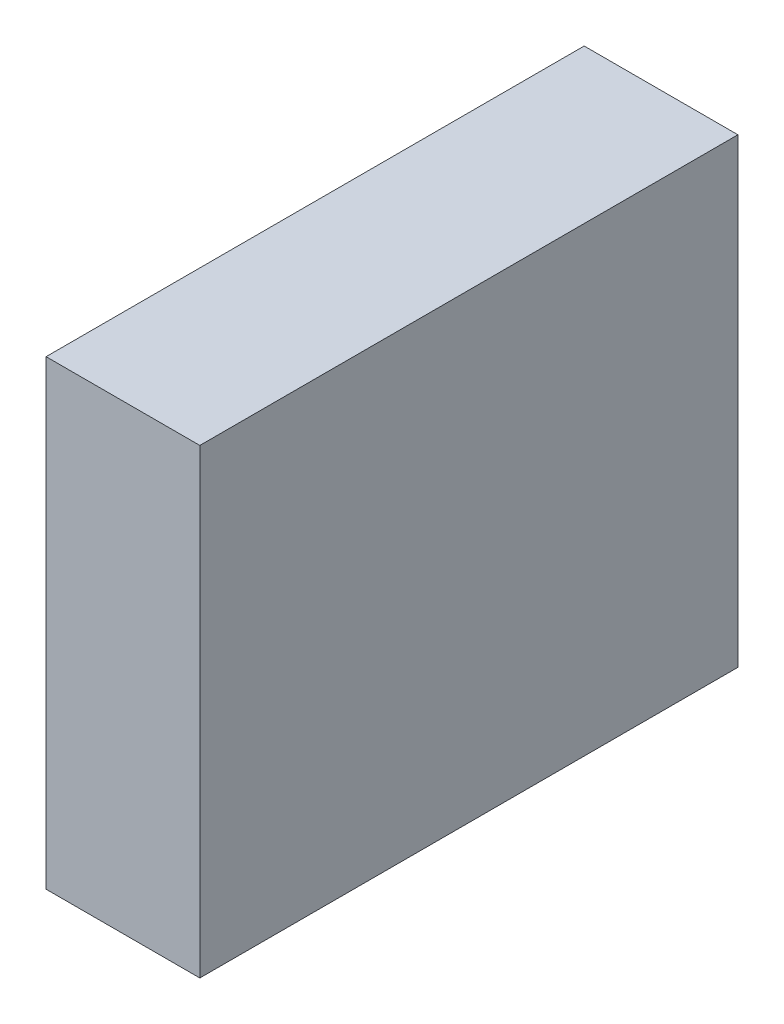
ISO-10303-21;
HEADER;
FILE_DESCRIPTION(('STEP AP214'),'2;1');
FILE_NAME('part.step','',(''),(''),'','','');
FILE_SCHEMA(('AUTOMOTIVE_DESIGN { 1 0 10303 214 1 1 1 1 }'));
ENDSEC;
DATA;
#1=APPLICATION_CONTEXT('core data for automotive mechanical design processes');
#2=APPLICATION_PROTOCOL_DEFINITION('international standard','automotive_design',2000,#1);
#3=PRODUCT_CONTEXT('',#1,'mechanical');
#4=PRODUCT('Part','Part','',(#3));
#5=PRODUCT_RELATED_PRODUCT_CATEGORY('part','',(#4));
#6=PRODUCT_DEFINITION_FORMATION('','',#4);
#7=PRODUCT_DEFINITION_CONTEXT('part definition',#1,'design');
#8=PRODUCT_DEFINITION('design','',#6,#7);
#9=PRODUCT_DEFINITION_SHAPE('','',#8);
#10=(LENGTH_UNIT() NAMED_UNIT(*) SI_UNIT(.MILLI.,.METRE.));
#11=(NAMED_UNIT(*) PLANE_ANGLE_UNIT() SI_UNIT($,.RADIAN.));
#12=(NAMED_UNIT(*) SI_UNIT($,.STERADIAN.) SOLID_ANGLE_UNIT());
#13=UNCERTAINTY_MEASURE_WITH_UNIT(LENGTH_MEASURE(1.E-05),#10,'distance_accuracy_value','');
#14=(GEOMETRIC_REPRESENTATION_CONTEXT(3) GLOBAL_UNCERTAINTY_ASSIGNED_CONTEXT((#13)) GLOBAL_UNIT_ASSIGNED_CONTEXT((#10,
#11,#12)) REPRESENTATION_CONTEXT('',''));
#15=CARTESIAN_POINT('',(0.,0.,0.));
#16=DIRECTION('',(0.,0.,1.));
#17=DIRECTION('',(1.,0.,0.));
#18=AXIS2_PLACEMENT_3D('',#15,#16,#17);
#19=CARTESIAN_POINT('',(12.7,0.,0.));
#20=DIRECTION('',(0.,0.,-1.));
#21=DIRECTION('',(0.,1.,0.));
#22=AXIS2_PLACEMENT_3D('',#19,#20,#21);
#23=PLANE('',#22);
#24=DIRECTION('',(0.,-1.,0.));
#25=VECTOR('',#24,1.);
#26=CARTESIAN_POINT('',(0.,0.,0.));
#27=LINE('',#26,#25);
#28=CARTESIAN_POINT('',(0.,38.1,0.));
#29=VERTEX_POINT('',#28);
#30=CARTESIAN_POINT('',(0.,0.,0.));
#31=VERTEX_POINT('',#30);
#32=EDGE_CURVE('E95',#29,#31,#27,.T.);
#33=ORIENTED_EDGE('',*,*,#32,.T.);
#34=DIRECTION('',(-1.,0.,0.));
#35=VECTOR('',#34,1.);
#36=CARTESIAN_POINT('',(12.7,0.,0.));
#37=LINE('',#36,#35);
#38=CARTESIAN_POINT('',(12.7,0.,0.));
#39=VERTEX_POINT('',#38);
#40=EDGE_CURVE('E11',#39,#31,#37,.T.);
#41=ORIENTED_EDGE('',*,*,#40,.F.);
#42=DIRECTION('',(0.,-1.,0.));
#43=VECTOR('',#42,1.);
#44=CARTESIAN_POINT('',(12.7,0.,0.));
#45=LINE('',#44,#43);
#46=CARTESIAN_POINT('',(12.7,38.1,0.));
#47=VERTEX_POINT('',#46);
#48=EDGE_CURVE('E83',#47,#39,#45,.T.);
#49=ORIENTED_EDGE('',*,*,#48,.F.);
#50=DIRECTION('',(-1.,0.,0.));
#51=VECTOR('',#50,1.);
#52=CARTESIAN_POINT('',(12.7,38.1,0.));
#53=LINE('',#52,#51);
#54=EDGE_CURVE('E91',#47,#29,#53,.T.);
#55=ORIENTED_EDGE('',*,*,#54,.T.);
#56=EDGE_LOOP('',(#33,#41,#49,#55));
#57=FACE_BOUND('',#56,.T.);
#58=ADVANCED_FACE('F32',(#57),#23,.F.);
#59=CARTESIAN_POINT('',(12.7,0.,0.));
#60=DIRECTION('',(0.,1.,0.));
#61=DIRECTION('',(0.,0.,1.));
#62=AXIS2_PLACEMENT_3D('',#59,#60,#61);
#63=PLANE('',#62);
#64=DIRECTION('',(0.,0.,-1.));
#65=VECTOR('',#64,1.);
#66=CARTESIAN_POINT('',(0.,0.,0.));
#67=LINE('',#66,#65);
#68=CARTESIAN_POINT('',(0.,0.,-44.45));
#69=VERTEX_POINT('',#68);
#70=EDGE_CURVE('E87',#31,#69,#67,.T.);
#71=ORIENTED_EDGE('',*,*,#70,.T.);
#72=DIRECTION('',(-1.,0.,0.));
#73=VECTOR('',#72,1.);
#74=CARTESIAN_POINT('',(12.7,0.,-44.45));
#75=LINE('',#74,#73);
#76=CARTESIAN_POINT('',(12.7,0.,-44.45));
#77=VERTEX_POINT('',#76);
#78=EDGE_CURVE('E40',#77,#69,#75,.T.);
#79=ORIENTED_EDGE('',*,*,#78,.F.);
#80=DIRECTION('',(0.,0.,-1.));
#81=VECTOR('',#80,1.);
#82=CARTESIAN_POINT('',(12.7,0.,0.));
#83=LINE('',#82,#81);
#84=EDGE_CURVE('E78',#39,#77,#83,.T.);
#85=ORIENTED_EDGE('',*,*,#84,.F.);
#86=ORIENTED_EDGE('',*,*,#40,.T.);
#87=EDGE_LOOP('',(#71,#79,#85,#86));
#88=FACE_BOUND('',#87,.T.);
#89=ADVANCED_FACE('F86',(#88),#63,.F.);
#90=CARTESIAN_POINT('',(12.7,0.,-44.45));
#91=DIRECTION('',(0.,0.,1.));
#92=DIRECTION('',(0.,-1.,0.));
#93=AXIS2_PLACEMENT_3D('',#90,#91,#92);
#94=PLANE('',#93);
#95=DIRECTION('',(0.,1.,0.));
#96=VECTOR('',#95,1.);
#97=CARTESIAN_POINT('',(0.,0.,-44.45));
#98=LINE('',#97,#96);
#99=CARTESIAN_POINT('',(0.,38.1,-44.45));
#100=VERTEX_POINT('',#99);
#101=EDGE_CURVE('E65',#69,#100,#98,.T.);
#102=ORIENTED_EDGE('',*,*,#101,.T.);
#103=DIRECTION('',(-1.,0.,0.));
#104=VECTOR('',#103,1.);
#105=CARTESIAN_POINT('',(12.7,38.1,-44.45));
#106=LINE('',#105,#104);
#107=CARTESIAN_POINT('',(12.7,38.1,-44.45));
#108=VERTEX_POINT('',#107);
#109=EDGE_CURVE('E88',#108,#100,#106,.T.);
#110=ORIENTED_EDGE('',*,*,#109,.F.);
#111=DIRECTION('',(0.,1.,0.));
#112=VECTOR('',#111,1.);
#113=CARTESIAN_POINT('',(12.7,0.,-44.45));
#114=LINE('',#113,#112);
#115=EDGE_CURVE('E81',#77,#108,#114,.T.);
#116=ORIENTED_EDGE('',*,*,#115,.F.);
#117=ORIENTED_EDGE('',*,*,#78,.T.);
#118=EDGE_LOOP('',(#102,#110,#116,#117));
#119=FACE_BOUND('',#118,.T.);
#120=ADVANCED_FACE('F89',(#119),#94,.F.);
#121=CARTESIAN_POINT('',(12.7,38.1,0.));
#122=DIRECTION('',(0.,-1.,0.));
#123=DIRECTION('',(0.,0.,-1.));
#124=AXIS2_PLACEMENT_3D('',#121,#122,#123);
#125=PLANE('',#124);
#126=DIRECTION('',(0.,0.,1.));
#127=VECTOR('',#126,1.);
#128=CARTESIAN_POINT('',(0.,38.1,0.));
#129=LINE('',#128,#127);
#130=EDGE_CURVE('E71',#100,#29,#129,.T.);
#131=ORIENTED_EDGE('',*,*,#130,.T.);
#132=ORIENTED_EDGE('',*,*,#54,.F.);
#133=DIRECTION('',(0.,0.,1.));
#134=VECTOR('',#133,1.);
#135=CARTESIAN_POINT('',(12.7,38.1,0.));
#136=LINE('',#135,#134);
#137=EDGE_CURVE('E48',#108,#47,#136,.T.);
#138=ORIENTED_EDGE('',*,*,#137,.F.);
#139=ORIENTED_EDGE('',*,*,#109,.T.);
#140=EDGE_LOOP('',(#131,#132,#138,#139));
#141=FACE_BOUND('',#140,.T.);
#142=ADVANCED_FACE('F102',(#141),#125,.F.);
#143=CARTESIAN_POINT('',(12.7,0.,0.));
#144=DIRECTION('',(-1.,0.,0.));
#145=DIRECTION('',(0.,0.,1.));
#146=AXIS2_PLACEMENT_3D('',#143,#144,#145);
#147=PLANE('',#146);
#148=ORIENTED_EDGE('',*,*,#48,.T.);
#149=ORIENTED_EDGE('',*,*,#84,.T.);
#150=ORIENTED_EDGE('',*,*,#115,.T.);
#151=ORIENTED_EDGE('',*,*,#137,.T.);
#152=EDGE_LOOP('',(#148,#149,#150,#151));
#153=FACE_BOUND('',#152,.T.);
#154=ADVANCED_FACE('F79',(#153),#147,.F.);
#155=CARTESIAN_POINT('',(0.,0.,0.));
#156=DIRECTION('',(-1.,0.,0.));
#157=DIRECTION('',(0.,0.,1.));
#158=AXIS2_PLACEMENT_3D('',#155,#156,#157);
#159=PLANE('',#158);
#160=ORIENTED_EDGE('',*,*,#32,.F.);
#161=ORIENTED_EDGE('',*,*,#130,.F.);
#162=ORIENTED_EDGE('',*,*,#101,.F.);
#163=ORIENTED_EDGE('',*,*,#70,.F.);
#164=EDGE_LOOP('',(#160,#161,#162,#163));
#165=FACE_BOUND('',#164,.T.);
#166=ADVANCED_FACE('F105',(#165),#159,.T.);
#167=CLOSED_SHELL('',(#58,#89,#120,#142,#154,#166));
#168=MANIFOLD_SOLID_BREP('B2',#167);
#169=ADVANCED_BREP_SHAPE_REPRESENTATION('',(#18,#168),#14);
#170=SHAPE_DEFINITION_REPRESENTATION(#9,#169);
ENDSEC;
END-ISO-10303-21;
